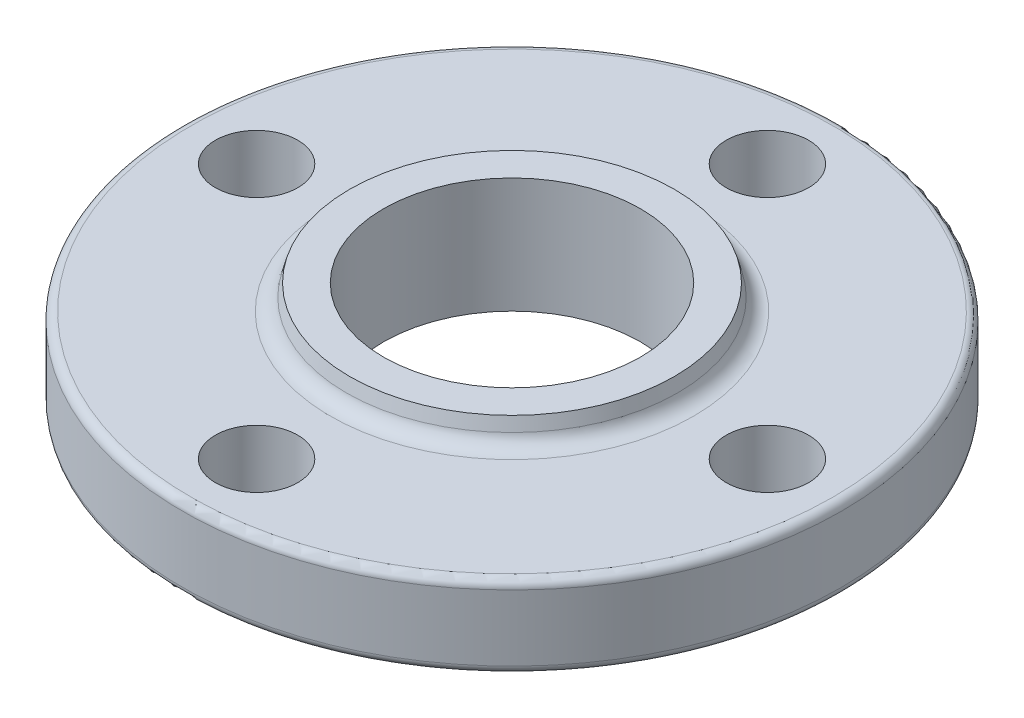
ISO-10303-21;
HEADER;
FILE_DESCRIPTION(('STEP AP214'),'2;1');
FILE_NAME('part.step','',(''),(''),'','','');
FILE_SCHEMA(('AUTOMOTIVE_DESIGN { 1 0 10303 214 1 1 1 1 }'));
ENDSEC;
DATA;
#1=APPLICATION_CONTEXT('core data for automotive mechanical design processes');
#2=APPLICATION_PROTOCOL_DEFINITION('international standard','automotive_design',2000,#1);
#3=PRODUCT_CONTEXT('',#1,'mechanical');
#4=PRODUCT('Part','Part','',(#3));
#5=PRODUCT_RELATED_PRODUCT_CATEGORY('part','',(#4));
#6=PRODUCT_DEFINITION_FORMATION('','',#4);
#7=PRODUCT_DEFINITION_CONTEXT('part definition',#1,'design');
#8=PRODUCT_DEFINITION('design','',#6,#7);
#9=PRODUCT_DEFINITION_SHAPE('','',#8);
#10=(LENGTH_UNIT() NAMED_UNIT(*) SI_UNIT(.MILLI.,.METRE.));
#11=(NAMED_UNIT(*) PLANE_ANGLE_UNIT() SI_UNIT($,.RADIAN.));
#12=(NAMED_UNIT(*) SI_UNIT($,.STERADIAN.) SOLID_ANGLE_UNIT());
#13=UNCERTAINTY_MEASURE_WITH_UNIT(LENGTH_MEASURE(1.E-05),#10,'distance_accuracy_value','');
#14=(GEOMETRIC_REPRESENTATION_CONTEXT(3) GLOBAL_UNCERTAINTY_ASSIGNED_CONTEXT((#13)) GLOBAL_UNIT_ASSIGNED_CONTEXT((#10,
#11,#12)) REPRESENTATION_CONTEXT('',''));
#15=CARTESIAN_POINT('',(0.,0.,0.));
#16=DIRECTION('',(0.,0.,1.));
#17=DIRECTION('',(1.,0.,0.));
#18=AXIS2_PLACEMENT_3D('',#15,#16,#17);
#19=CARTESIAN_POINT('',(0.,22.225,0.));
#20=DIRECTION('',(0.,1.,0.));
#21=DIRECTION('',(-1.,0.,0.));
#22=AXIS2_PLACEMENT_3D('',#19,#20,#21);
#23=CYLINDRICAL_SURFACE('',#22,24.765);
#24=CARTESIAN_POINT('',(0.,0.,0.));
#25=DIRECTION('',(0.,1.,0.));
#26=DIRECTION('',(-1.,0.,0.));
#27=AXIS2_PLACEMENT_3D('',#24,#25,#26);
#28=CIRCLE('',#27,24.765);
#29=CARTESIAN_POINT('',(-24.765,0.,0.));
#30=VERTEX_POINT('',#29);
#31=EDGE_CURVE('E60',#30,#30,#28,.T.);
#32=ORIENTED_EDGE('',*,*,#31,.F.);
#33=EDGE_LOOP('',(#32));
#34=FACE_BOUND('',#33,.T.);
#35=CARTESIAN_POINT('',(0.,22.225,0.));
#36=DIRECTION('',(0.,1.,0.));
#37=DIRECTION('',(-1.,0.,0.));
#38=AXIS2_PLACEMENT_3D('',#35,#36,#37);
#39=CIRCLE('',#38,24.765);
#40=CARTESIAN_POINT('',(-24.765,22.225,0.));
#41=VERTEX_POINT('',#40);
#42=EDGE_CURVE('E64',#41,#41,#39,.T.);
#43=ORIENTED_EDGE('',*,*,#42,.T.);
#44=EDGE_LOOP('',(#43));
#45=FACE_BOUND('',#44,.T.);
#46=ADVANCED_FACE('F31',(#34,#45),#23,.F.);
#47=CARTESIAN_POINT('',(24.765,0.,0.));
#48=DIRECTION('',(0.,1.,0.));
#49=DIRECTION('',(-1.,0.,0.));
#50=AXIS2_PLACEMENT_3D('',#47,#48,#49);
#51=PLANE('',#50);
#52=CARTESIAN_POINT('',(0.,0.,0.));
#53=DIRECTION('',(0.,1.,0.));
#54=DIRECTION('',(-1.,0.,0.));
#55=AXIS2_PLACEMENT_3D('',#52,#53,#54);
#56=CIRCLE('',#55,36.5125);
#57=CARTESIAN_POINT('',(-36.5125,0.,0.));
#58=VERTEX_POINT('',#57);
#59=EDGE_CURVE('E68',#58,#58,#56,.T.);
#60=ORIENTED_EDGE('',*,*,#59,.F.);
#61=EDGE_LOOP('',(#60));
#62=FACE_BOUND('',#61,.T.);
#63=ORIENTED_EDGE('',*,*,#31,.T.);
#64=EDGE_LOOP('',(#63));
#65=FACE_BOUND('',#64,.T.);
#66=ADVANCED_FACE('F104',(#62,#65),#51,.F.);
#67=CARTESIAN_POINT('',(36.5125,1.5875,0.));
#68=DIRECTION('',(0.,1.,0.));
#69=DIRECTION('',(-1.,0.,0.));
#70=AXIS2_PLACEMENT_3D('',#67,#68,#69);
#71=PLANE('',#70);
#72=CARTESIAN_POINT('',(0.,1.58749999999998,0.));
#73=DIRECTION('',(0.,1.,0.));
#74=DIRECTION('',(-1.,0.,0.));
#75=AXIS2_PLACEMENT_3D('',#72,#73,#74);
#76=CIRCLE('',#75,61.9125);
#77=CARTESIAN_POINT('',(-61.9125,1.58749999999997,0.));
#78=VERTEX_POINT('',#77);
#79=EDGE_CURVE('E38',#78,#78,#76,.F.);
#80=ORIENTED_EDGE('',*,*,#79,.T.);
#81=EDGE_LOOP('',(#80));
#82=FACE_BOUND('',#81,.T.);
#83=CARTESIAN_POINT('',(0.,1.58749999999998,0.));
#84=DIRECTION('',(0.,1.,0.));
#85=DIRECTION('',(-1.,0.,0.));
#86=AXIS2_PLACEMENT_3D('',#83,#84,#85);
#87=CIRCLE('',#86,38.1);
#88=CARTESIAN_POINT('',(-38.1,1.58749999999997,0.));
#89=VERTEX_POINT('',#88);
#90=EDGE_CURVE('E57',#89,#89,#87,.T.);
#91=ORIENTED_EDGE('',*,*,#90,.T.);
#92=EDGE_LOOP('',(#91));
#93=FACE_BOUND('',#92,.T.);
#94=CARTESIAN_POINT('',(5.14978239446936E-13,1.58749999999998,-49.2125));
#95=DIRECTION('',(0.,-1.,0.));
#96=DIRECTION('',(0.,0.,-1.));
#97=AXIS2_PLACEMENT_3D('',#94,#95,#96);
#98=CIRCLE('',#97,7.9375);
#99=CARTESIAN_POINT('',(5.98119186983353E-13,1.58749999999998,-57.15));
#100=VERTEX_POINT('',#99);
#101=EDGE_CURVE('E93',#100,#100,#98,.T.);
#102=ORIENTED_EDGE('',*,*,#101,.F.);
#103=EDGE_LOOP('',(#102));
#104=FACE_BOUND('',#103,.T.);
#105=CARTESIAN_POINT('',(-49.2125,1.58749999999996,-3.43649249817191E-13));
#106=DIRECTION('',(0.,-1.,0.));
#107=DIRECTION('',(-1.,0.,0.));
#108=AXIS2_PLACEMENT_3D('',#105,#106,#107);
#109=CIRCLE('',#108,7.9375);
#110=CARTESIAN_POINT('',(-57.15,1.58749999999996,-3.99076548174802E-13));
#111=VERTEX_POINT('',#110);
#112=EDGE_CURVE('E87',#111,#111,#109,.T.);
#113=ORIENTED_EDGE('',*,*,#112,.F.);
#114=EDGE_LOOP('',(#113));
#115=FACE_BOUND('',#114,.T.);
#116=CARTESIAN_POINT('',(-1.72320260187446E-13,1.58749999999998,49.2125));
#117=DIRECTION('',(0.,-1.,0.));
#118=DIRECTION('',(0.,0.,1.));
#119=AXIS2_PLACEMENT_3D('',#116,#117,#118);
#120=CIRCLE('',#119,7.9375);
#121=CARTESIAN_POINT('',(-2.00033909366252E-13,1.58749999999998,57.15));
#122=VERTEX_POINT('',#121);
#123=EDGE_CURVE('E81',#122,#122,#120,.T.);
#124=ORIENTED_EDGE('',*,*,#123,.F.);
#125=EDGE_LOOP('',(#124));
#126=FACE_BOUND('',#125,.T.);
#127=CARTESIAN_POINT('',(49.2125,1.5875,0.));
#128=DIRECTION('',(0.,-1.,0.));
#129=DIRECTION('',(1.,0.,0.));
#130=AXIS2_PLACEMENT_3D('',#127,#128,#129);
#131=CIRCLE('',#130,7.9375);
#132=CARTESIAN_POINT('',(57.15,1.5875,0.));
#133=VERTEX_POINT('',#132);
#134=EDGE_CURVE('E65',#133,#133,#131,.T.);
#135=ORIENTED_EDGE('',*,*,#134,.F.);
#136=EDGE_LOOP('',(#135));
#137=FACE_BOUND('',#136,.T.);
#138=ADVANCED_FACE('F100',(#82,#93,#104,#115,#126,#137),#71,.F.);
#139=CARTESIAN_POINT('',(0.,22.225,0.));
#140=DIRECTION('',(0.,1.,0.));
#141=DIRECTION('',(-1.,0.,0.));
#142=AXIS2_PLACEMENT_3D('',#139,#140,#141);
#143=CYLINDRICAL_SURFACE('',#142,63.5);
#144=CARTESIAN_POINT('',(0.,3.17499999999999,0.));
#145=DIRECTION('',(0.,1.,0.));
#146=DIRECTION('',(-1.,0.,0.));
#147=AXIS2_PLACEMENT_3D('',#144,#145,#146);
#148=CIRCLE('',#147,63.5);
#149=CARTESIAN_POINT('',(-63.5,3.17499999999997,0.));
#150=VERTEX_POINT('',#149);
#151=EDGE_CURVE('E42',#150,#150,#148,.T.);
#152=ORIENTED_EDGE('',*,*,#151,.T.);
#153=EDGE_LOOP('',(#152));
#154=FACE_BOUND('',#153,.T.);
#155=CARTESIAN_POINT('',(0.,15.875,0.));
#156=DIRECTION('',(0.,-1.,0.));
#157=DIRECTION('',(1.,0.,0.));
#158=AXIS2_PLACEMENT_3D('',#155,#156,#157);
#159=CIRCLE('',#158,63.5);
#160=CARTESIAN_POINT('',(63.5,15.875,0.));
#161=VERTEX_POINT('',#160);
#162=EDGE_CURVE('E46',#161,#161,#159,.T.);
#163=ORIENTED_EDGE('',*,*,#162,.T.);
#164=EDGE_LOOP('',(#163));
#165=FACE_BOUND('',#164,.T.);
#166=ADVANCED_FACE('F103',(#154,#165),#143,.T.);
#167=CARTESIAN_POINT('',(63.5,17.4625,0.));
#168=DIRECTION('',(0.,-1.,0.));
#169=DIRECTION('',(1.,0.,0.));
#170=AXIS2_PLACEMENT_3D('',#167,#168,#169);
#171=PLANE('',#170);
#172=CARTESIAN_POINT('',(0.,17.4625,0.));
#173=DIRECTION('',(0.,-1.,0.));
#174=DIRECTION('',(1.,0.,0.));
#175=AXIS2_PLACEMENT_3D('',#172,#173,#174);
#176=CIRCLE('',#175,61.9125);
#177=CARTESIAN_POINT('',(61.9125,17.4625,0.));
#178=VERTEX_POINT('',#177);
#179=EDGE_CURVE('E10',#178,#178,#176,.F.);
#180=ORIENTED_EDGE('',*,*,#179,.T.);
#181=EDGE_LOOP('',(#180));
#182=FACE_BOUND('',#181,.T.);
#183=CARTESIAN_POINT('',(0.,17.4625,0.));
#184=DIRECTION('',(0.,-1.,0.));
#185=DIRECTION('',(1.,0.,0.));
#186=AXIS2_PLACEMENT_3D('',#183,#184,#185);
#187=CIRCLE('',#186,34.9800131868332);
#188=CARTESIAN_POINT('',(34.9800131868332,17.4625,0.));
#189=VERTEX_POINT('',#188);
#190=EDGE_CURVE('E51',#189,#189,#187,.T.);
#191=ORIENTED_EDGE('',*,*,#190,.T.);
#192=EDGE_LOOP('',(#191));
#193=FACE_BOUND('',#192,.T.);
#194=CARTESIAN_POINT('',(5.10021886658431E-13,17.4625,-49.2125));
#195=DIRECTION('',(0.,-1.,0.));
#196=DIRECTION('',(0.,0.,-1.));
#197=AXIS2_PLACEMENT_3D('',#194,#195,#196);
#198=CIRCLE('',#197,7.9375);
#199=CARTESIAN_POINT('',(5.93162834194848E-13,17.4625,-57.15));
#200=VERTEX_POINT('',#199);
#201=EDGE_CURVE('E90',#200,#200,#198,.T.);
#202=ORIENTED_EDGE('',*,*,#201,.T.);
#203=EDGE_LOOP('',(#202));
#204=FACE_BOUND('',#203,.T.);
#205=CARTESIAN_POINT('',(-49.2125,17.4625,-3.43649249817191E-13));
#206=DIRECTION('',(0.,-1.,0.));
#207=DIRECTION('',(-1.,0.,0.));
#208=AXIS2_PLACEMENT_3D('',#205,#206,#207);
#209=CIRCLE('',#208,7.9375);
#210=CARTESIAN_POINT('',(-57.15,17.4625,-3.99076548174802E-13));
#211=VERTEX_POINT('',#210);
#212=EDGE_CURVE('E84',#211,#211,#209,.T.);
#213=ORIENTED_EDGE('',*,*,#212,.T.);
#214=EDGE_LOOP('',(#213));
#215=FACE_BOUND('',#214,.T.);
#216=CARTESIAN_POINT('',(-1.77276612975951E-13,17.4625,49.2125));
#217=DIRECTION('',(0.,-1.,0.));
#218=DIRECTION('',(0.,0.,1.));
#219=AXIS2_PLACEMENT_3D('',#216,#217,#218);
#220=CIRCLE('',#219,7.9375);
#221=CARTESIAN_POINT('',(-2.04990262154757E-13,17.4625,57.15));
#222=VERTEX_POINT('',#221);
#223=EDGE_CURVE('E78',#222,#222,#220,.T.);
#224=ORIENTED_EDGE('',*,*,#223,.T.);
#225=EDGE_LOOP('',(#224));
#226=FACE_BOUND('',#225,.T.);
#227=CARTESIAN_POINT('',(49.2125,17.4625,0.));
#228=DIRECTION('',(0.,-1.,0.));
#229=DIRECTION('',(1.,0.,0.));
#230=AXIS2_PLACEMENT_3D('',#227,#228,#229);
#231=CIRCLE('',#230,7.9375);
#232=CARTESIAN_POINT('',(57.15,17.4625,0.));
#233=VERTEX_POINT('',#232);
#234=EDGE_CURVE('E61',#233,#233,#231,.T.);
#235=ORIENTED_EDGE('',*,*,#234,.T.);
#236=EDGE_LOOP('',(#235));
#237=FACE_BOUND('',#236,.T.);
#238=ADVANCED_FACE('F120',(#182,#193,#204,#215,#226,#237),#171,.F.);
#239=CARTESIAN_POINT('',(0.,17.4625,0.));
#240=DIRECTION('',(0.,-1.,0.));
#241=DIRECTION('',(1.,0.,0.));
#242=AXIS2_PLACEMENT_3D('',#239,#240,#241);
#243=CONICAL_SURFACE('',#242,32.54375,0.261799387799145);
#244=CARTESIAN_POINT('',(0.,19.8157495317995,0.));
#245=DIRECTION('',(0.,-1.,0.));
#246=DIRECTION('',(1.,0.,0.));
#247=AXIS2_PLACEMENT_3D('',#244,#245,#246);
#248=CIRCLE('',#247,31.9131986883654);
#249=CARTESIAN_POINT('',(31.9131986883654,19.8157495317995,0.));
#250=VERTEX_POINT('',#249);
#251=EDGE_CURVE('E54',#250,#250,#248,.F.);
#252=ORIENTED_EDGE('',*,*,#251,.T.);
#253=EDGE_LOOP('',(#252));
#254=FACE_BOUND('',#253,.T.);
#255=CARTESIAN_POINT('',(0.,22.225,0.));
#256=DIRECTION('',(0.,1.,0.));
#257=DIRECTION('',(-1.,0.,0.));
#258=AXIS2_PLACEMENT_3D('',#255,#256,#257);
#259=CIRCLE('',#258,31.2676419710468);
#260=CARTESIAN_POINT('',(-31.2676419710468,22.225,0.));
#261=VERTEX_POINT('',#260);
#262=EDGE_CURVE('E71',#261,#261,#259,.T.);
#263=ORIENTED_EDGE('',*,*,#262,.F.);
#264=EDGE_LOOP('',(#263));
#265=FACE_BOUND('',#264,.T.);
#266=ADVANCED_FACE('F122',(#254,#265),#243,.T.);
#267=CARTESIAN_POINT('',(31.2676419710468,22.225,0.));
#268=DIRECTION('',(0.,-1.,0.));
#269=DIRECTION('',(1.,0.,0.));
#270=AXIS2_PLACEMENT_3D('',#267,#268,#269);
#271=PLANE('',#270);
#272=ORIENTED_EDGE('',*,*,#42,.F.);
#273=EDGE_LOOP('',(#272));
#274=FACE_BOUND('',#273,.T.);
#275=ORIENTED_EDGE('',*,*,#262,.T.);
#276=EDGE_LOOP('',(#275));
#277=FACE_BOUND('',#276,.T.);
#278=ADVANCED_FACE('F116',(#274,#277),#271,.F.);
#279=CARTESIAN_POINT('',(49.2125,22.225,0.));
#280=DIRECTION('',(0.,-1.,0.));
#281=DIRECTION('',(1.,0.,0.));
#282=AXIS2_PLACEMENT_3D('',#279,#280,#281);
#283=CYLINDRICAL_SURFACE('',#282,7.9375);
#284=ORIENTED_EDGE('',*,*,#134,.T.);
#285=EDGE_LOOP('',(#284));
#286=FACE_BOUND('',#285,.T.);
#287=ORIENTED_EDGE('',*,*,#234,.F.);
#288=EDGE_LOOP('',(#287));
#289=FACE_BOUND('',#288,.T.);
#290=ADVANCED_FACE('F112',(#286,#289),#283,.F.);
#291=CARTESIAN_POINT('',(-1.78763518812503E-13,22.225,49.2125));
#292=DIRECTION('',(0.,-1.,0.));
#293=DIRECTION('',(0.,0.,1.));
#294=AXIS2_PLACEMENT_3D('',#291,#292,#293);
#295=CYLINDRICAL_SURFACE('',#294,7.9375);
#296=ORIENTED_EDGE('',*,*,#123,.T.);
#297=EDGE_LOOP('',(#296));
#298=FACE_BOUND('',#297,.T.);
#299=ORIENTED_EDGE('',*,*,#223,.F.);
#300=EDGE_LOOP('',(#299));
#301=FACE_BOUND('',#300,.T.);
#302=ADVANCED_FACE('F115',(#298,#301),#295,.F.);
#303=CARTESIAN_POINT('',(-49.2125,22.225,-3.43649249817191E-13));
#304=DIRECTION('',(0.,-1.,0.));
#305=DIRECTION('',(-1.,0.,0.));
#306=AXIS2_PLACEMENT_3D('',#303,#304,#305);
#307=CYLINDRICAL_SURFACE('',#306,7.9375);
#308=ORIENTED_EDGE('',*,*,#112,.T.);
#309=EDGE_LOOP('',(#308));
#310=FACE_BOUND('',#309,.T.);
#311=ORIENTED_EDGE('',*,*,#212,.F.);
#312=EDGE_LOOP('',(#311));
#313=FACE_BOUND('',#312,.T.);
#314=ADVANCED_FACE('F215',(#310,#313),#307,.F.);
#315=CARTESIAN_POINT('',(5.08534980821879E-13,22.225,-49.2125));
#316=DIRECTION('',(0.,-1.,0.));
#317=DIRECTION('',(0.,0.,-1.));
#318=AXIS2_PLACEMENT_3D('',#315,#316,#317);
#319=CYLINDRICAL_SURFACE('',#318,7.9375);
#320=ORIENTED_EDGE('',*,*,#101,.T.);
#321=EDGE_LOOP('',(#320));
#322=FACE_BOUND('',#321,.T.);
#323=ORIENTED_EDGE('',*,*,#201,.F.);
#324=EDGE_LOOP('',(#323));
#325=FACE_BOUND('',#324,.T.);
#326=ADVANCED_FACE('F97',(#322,#325),#319,.F.);
#327=CARTESIAN_POINT('',(0.,0.,0.));
#328=DIRECTION('',(0.,1.,0.));
#329=DIRECTION('',(-1.,0.,0.));
#330=AXIS2_PLACEMENT_3D('',#327,#328,#329);
#331=TOROIDAL_SURFACE('',#330,38.1,1.5875);
#332=ORIENTED_EDGE('',*,*,#59,.T.);
#333=EDGE_LOOP('',(#332));
#334=FACE_BOUND('',#333,.T.);
#335=ORIENTED_EDGE('',*,*,#90,.F.);
#336=EDGE_LOOP('',(#335));
#337=FACE_BOUND('',#336,.T.);
#338=ADVANCED_FACE('F144',(#334,#337),#331,.F.);
#339=CARTESIAN_POINT('',(0.,20.6375,0.));
#340=DIRECTION('',(0.,-1.,0.));
#341=DIRECTION('',(1.,0.,0.));
#342=AXIS2_PLACEMENT_3D('',#339,#340,#341);
#343=TOROIDAL_SURFACE('',#342,34.9800131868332,3.175);
#344=ORIENTED_EDGE('',*,*,#190,.F.);
#345=EDGE_LOOP('',(#344));
#346=FACE_BOUND('',#345,.T.);
#347=ORIENTED_EDGE('',*,*,#251,.F.);
#348=EDGE_LOOP('',(#347));
#349=FACE_BOUND('',#348,.T.);
#350=ADVANCED_FACE('F147',(#346,#349),#343,.F.);
#351=CARTESIAN_POINT('',(0.,3.17499999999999,0.));
#352=DIRECTION('',(0.,1.,0.));
#353=DIRECTION('',(-1.,0.,0.));
#354=AXIS2_PLACEMENT_3D('',#351,#352,#353);
#355=TOROIDAL_SURFACE('',#354,61.9125,1.5875);
#356=ORIENTED_EDGE('',*,*,#79,.F.);
#357=EDGE_LOOP('',(#356));
#358=FACE_BOUND('',#357,.T.);
#359=ORIENTED_EDGE('',*,*,#151,.F.);
#360=EDGE_LOOP('',(#359));
#361=FACE_BOUND('',#360,.T.);
#362=ADVANCED_FACE('F150',(#358,#361),#355,.T.);
#363=CARTESIAN_POINT('',(0.,15.875,0.));
#364=DIRECTION('',(0.,-1.,0.));
#365=DIRECTION('',(1.,0.,0.));
#366=AXIS2_PLACEMENT_3D('',#363,#364,#365);
#367=TOROIDAL_SURFACE('',#366,61.9125,1.5875);
#368=ORIENTED_EDGE('',*,*,#162,.F.);
#369=EDGE_LOOP('',(#368));
#370=FACE_BOUND('',#369,.T.);
#371=ORIENTED_EDGE('',*,*,#179,.F.);
#372=EDGE_LOOP('',(#371));
#373=FACE_BOUND('',#372,.T.);
#374=ADVANCED_FACE('F33',(#370,#373),#367,.T.);
#375=CLOSED_SHELL('',(#46,#66,#138,#166,#238,#266,#278,#290,#302,#314,#326,#338,#350,#362,#374));
#376=MANIFOLD_SOLID_BREP('B2',#375);
#377=ADVANCED_BREP_SHAPE_REPRESENTATION('',(#18,#376),#14);
#378=SHAPE_DEFINITION_REPRESENTATION(#9,#377);
ENDSEC;
END-ISO-10303-21;
